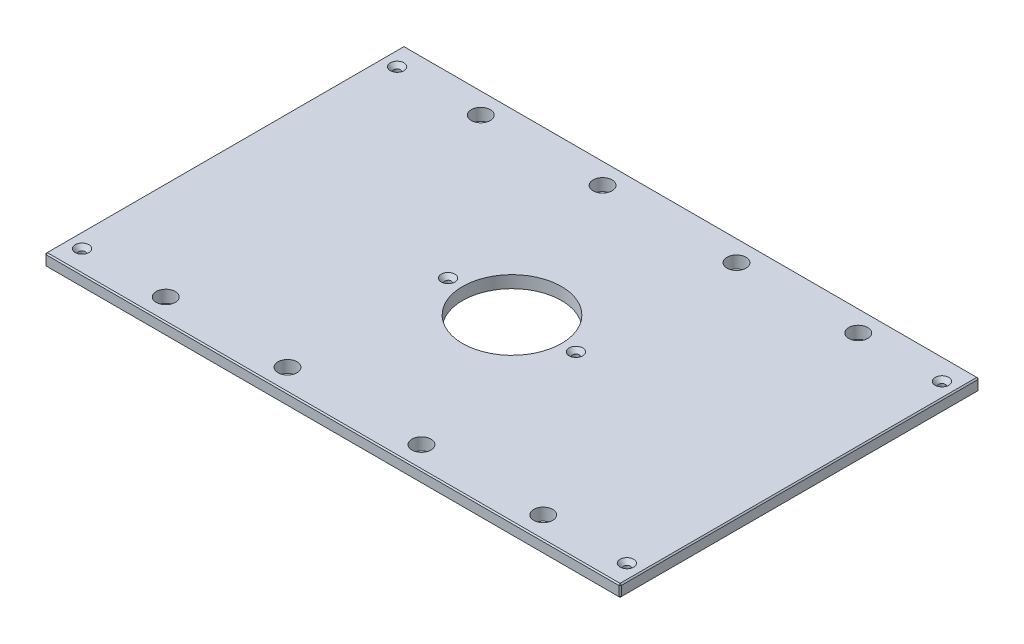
ISO-10303-21;
HEADER;
FILE_DESCRIPTION(('STEP AP214'),'2;1');
FILE_NAME('part.step','',(''),(''),'','','');
FILE_SCHEMA(('AUTOMOTIVE_DESIGN { 1 0 10303 214 1 1 1 1 }'));
ENDSEC;
DATA;
#1=APPLICATION_CONTEXT('core data for automotive mechanical design processes');
#2=APPLICATION_PROTOCOL_DEFINITION('international standard','automotive_design',2000,#1);
#3=PRODUCT_CONTEXT('',#1,'mechanical');
#4=PRODUCT('Part','Part','',(#3));
#5=PRODUCT_RELATED_PRODUCT_CATEGORY('part','',(#4));
#6=PRODUCT_DEFINITION_FORMATION('','',#4);
#7=PRODUCT_DEFINITION_CONTEXT('part definition',#1,'design');
#8=PRODUCT_DEFINITION('design','',#6,#7);
#9=PRODUCT_DEFINITION_SHAPE('','',#8);
#10=(LENGTH_UNIT() NAMED_UNIT(*) SI_UNIT(.MILLI.,.METRE.));
#11=(NAMED_UNIT(*) PLANE_ANGLE_UNIT() SI_UNIT($,.RADIAN.));
#12=(NAMED_UNIT(*) SI_UNIT($,.STERADIAN.) SOLID_ANGLE_UNIT());
#13=UNCERTAINTY_MEASURE_WITH_UNIT(LENGTH_MEASURE(1.E-05),#10,'distance_accuracy_value','');
#14=(GEOMETRIC_REPRESENTATION_CONTEXT(3) GLOBAL_UNCERTAINTY_ASSIGNED_CONTEXT((#13)) GLOBAL_UNIT_ASSIGNED_CONTEXT((#10,
#11,#12)) REPRESENTATION_CONTEXT('',''));
#15=CARTESIAN_POINT('',(0.,0.,0.));
#16=DIRECTION('',(0.,0.,1.));
#17=DIRECTION('',(1.,0.,0.));
#18=AXIS2_PLACEMENT_3D('',#15,#16,#17);
#19=CARTESIAN_POINT('',(-300.0375,12.7,-187.325));
#20=DIRECTION('',(1.,0.,0.));
#21=DIRECTION('',(0.,0.,-1.));
#22=AXIS2_PLACEMENT_3D('',#19,#20,#21);
#23=PLANE('',#22);
#24=DIRECTION('',(0.,0.,-1.));
#25=VECTOR('',#24,1.);
#26=CARTESIAN_POINT('',(-300.0375,11.43,-187.325));
#27=LINE('',#26,#25);
#28=CARTESIAN_POINT('',(-300.0375,11.43,186.055));
#29=VERTEX_POINT('',#28);
#30=CARTESIAN_POINT('',(-300.0375,11.43,-186.055));
#31=VERTEX_POINT('',#30);
#32=EDGE_CURVE('E134',#29,#31,#27,.T.);
#33=ORIENTED_EDGE('',*,*,#32,.T.);
#34=DIRECTION('',(0.,-1.,0.));
#35=VECTOR('',#34,1.);
#36=CARTESIAN_POINT('',(-300.0375,12.7,-186.055));
#37=LINE('',#36,#35);
#38=CARTESIAN_POINT('',(-300.0375,1.26999999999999,-186.055));
#39=VERTEX_POINT('',#38);
#40=EDGE_CURVE('E130',#31,#39,#37,.T.);
#41=ORIENTED_EDGE('',*,*,#40,.T.);
#42=DIRECTION('',(0.,0.,1.));
#43=VECTOR('',#42,1.);
#44=CARTESIAN_POINT('',(-300.0375,1.26999999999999,-187.325));
#45=LINE('',#44,#43);
#46=CARTESIAN_POINT('',(-300.0375,1.26999999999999,186.055));
#47=VERTEX_POINT('',#46);
#48=EDGE_CURVE('E125',#39,#47,#45,.T.);
#49=ORIENTED_EDGE('',*,*,#48,.T.);
#50=DIRECTION('',(0.,1.,0.));
#51=VECTOR('',#50,1.);
#52=CARTESIAN_POINT('',(-300.0375,12.7,186.055));
#53=LINE('',#52,#51);
#54=EDGE_CURVE('E127',#47,#29,#53,.T.);
#55=ORIENTED_EDGE('',*,*,#54,.T.);
#56=EDGE_LOOP('',(#33,#41,#49,#55));
#57=FACE_BOUND('',#56,.T.);
#58=ADVANCED_FACE('F34',(#57),#23,.F.);
#59=CARTESIAN_POINT('',(-300.0375,12.7,187.325));
#60=DIRECTION('',(0.,0.,-1.));
#61=DIRECTION('',(-1.,0.,0.));
#62=AXIS2_PLACEMENT_3D('',#59,#60,#61);
#63=PLANE('',#62);
#64=DIRECTION('',(1.,0.,0.));
#65=VECTOR('',#64,1.);
#66=CARTESIAN_POINT('',(-300.0375,1.26999999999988,187.325));
#67=LINE('',#66,#65);
#68=CARTESIAN_POINT('',(-298.7675,1.26999999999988,187.325));
#69=VERTEX_POINT('',#68);
#70=CARTESIAN_POINT('',(298.7675,1.26999999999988,187.325));
#71=VERTEX_POINT('',#70);
#72=EDGE_CURVE('E57',#69,#71,#67,.T.);
#73=ORIENTED_EDGE('',*,*,#72,.T.);
#74=DIRECTION('',(0.,1.,0.));
#75=VECTOR('',#74,1.);
#76=CARTESIAN_POINT('',(298.7675,12.7,187.325));
#77=LINE('',#76,#75);
#78=CARTESIAN_POINT('',(298.7675,11.4300000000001,187.325));
#79=VERTEX_POINT('',#78);
#80=EDGE_CURVE('E11',#71,#79,#77,.T.);
#81=ORIENTED_EDGE('',*,*,#80,.T.);
#82=DIRECTION('',(-1.,0.,0.));
#83=VECTOR('',#82,1.);
#84=CARTESIAN_POINT('',(-300.0375,11.4300000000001,187.325));
#85=LINE('',#84,#83);
#86=CARTESIAN_POINT('',(-298.7675,11.4300000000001,187.325));
#87=VERTEX_POINT('',#86);
#88=EDGE_CURVE('E43',#79,#87,#85,.T.);
#89=ORIENTED_EDGE('',*,*,#88,.T.);
#90=DIRECTION('',(0.,-1.,0.));
#91=VECTOR('',#90,1.);
#92=CARTESIAN_POINT('',(-298.7675,12.7,187.325));
#93=LINE('',#92,#91);
#94=EDGE_CURVE('E302',#87,#69,#93,.T.);
#95=ORIENTED_EDGE('',*,*,#94,.T.);
#96=EDGE_LOOP('',(#73,#81,#89,#95));
#97=FACE_BOUND('',#96,.T.);
#98=ADVANCED_FACE('F371',(#97),#63,.F.);
#99=CARTESIAN_POINT('',(300.0375,12.7,-187.325));
#100=DIRECTION('',(-1.,0.,0.));
#101=DIRECTION('',(0.,0.,1.));
#102=AXIS2_PLACEMENT_3D('',#99,#100,#101);
#103=PLANE('',#102);
#104=DIRECTION('',(0.,0.,-1.));
#105=VECTOR('',#104,1.);
#106=CARTESIAN_POINT('',(300.0375,1.26999999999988,-187.325));
#107=LINE('',#106,#105);
#108=CARTESIAN_POINT('',(300.0375,1.26999999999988,186.055));
#109=VERTEX_POINT('',#108);
#110=CARTESIAN_POINT('',(300.0375,1.26999999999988,-186.055));
#111=VERTEX_POINT('',#110);
#112=EDGE_CURVE('E297',#109,#111,#107,.T.);
#113=ORIENTED_EDGE('',*,*,#112,.T.);
#114=DIRECTION('',(0.,1.,0.));
#115=VECTOR('',#114,1.);
#116=CARTESIAN_POINT('',(300.0375,12.7,-186.055));
#117=LINE('',#116,#115);
#118=CARTESIAN_POINT('',(300.0375,11.43,-186.055));
#119=VERTEX_POINT('',#118);
#120=EDGE_CURVE('E299',#111,#119,#117,.T.);
#121=ORIENTED_EDGE('',*,*,#120,.T.);
#122=DIRECTION('',(0.,0.,1.));
#123=VECTOR('',#122,1.);
#124=CARTESIAN_POINT('',(300.0375,11.43,187.325));
#125=LINE('',#124,#123);
#126=CARTESIAN_POINT('',(300.0375,11.43,186.055));
#127=VERTEX_POINT('',#126);
#128=EDGE_CURVE('E295',#119,#127,#125,.T.);
#129=ORIENTED_EDGE('',*,*,#128,.T.);
#130=DIRECTION('',(0.,-1.,0.));
#131=VECTOR('',#130,1.);
#132=CARTESIAN_POINT('',(300.0375,12.7,186.055));
#133=LINE('',#132,#131);
#134=EDGE_CURVE('E293',#127,#109,#133,.T.);
#135=ORIENTED_EDGE('',*,*,#134,.T.);
#136=EDGE_LOOP('',(#113,#121,#129,#135));
#137=FACE_BOUND('',#136,.T.);
#138=ADVANCED_FACE('F358',(#137),#103,.F.);
#139=CARTESIAN_POINT('',(-300.0375,12.7,-187.325));
#140=DIRECTION('',(0.,0.,1.));
#141=DIRECTION('',(1.,0.,0.));
#142=AXIS2_PLACEMENT_3D('',#139,#140,#141);
#143=PLANE('',#142);
#144=DIRECTION('',(-1.,0.,0.));
#145=VECTOR('',#144,1.);
#146=CARTESIAN_POINT('',(-300.0375,1.26999999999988,-187.325));
#147=LINE('',#146,#145);
#148=CARTESIAN_POINT('',(298.7675,1.26999999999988,-187.325));
#149=VERTEX_POINT('',#148);
#150=CARTESIAN_POINT('',(-298.7675,1.26999999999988,-187.325));
#151=VERTEX_POINT('',#150);
#152=EDGE_CURVE('E269',#149,#151,#147,.T.);
#153=ORIENTED_EDGE('',*,*,#152,.T.);
#154=DIRECTION('',(0.,1.,0.));
#155=VECTOR('',#154,1.);
#156=CARTESIAN_POINT('',(-298.7675,12.7,-187.325));
#157=LINE('',#156,#155);
#158=CARTESIAN_POINT('',(-298.7675,11.43,-187.325));
#159=VERTEX_POINT('',#158);
#160=EDGE_CURVE('E273',#151,#159,#157,.T.);
#161=ORIENTED_EDGE('',*,*,#160,.T.);
#162=DIRECTION('',(1.,0.,0.));
#163=VECTOR('',#162,1.);
#164=CARTESIAN_POINT('',(300.0375,11.43,-187.325));
#165=LINE('',#164,#163);
#166=CARTESIAN_POINT('',(298.7675,11.43,-187.325));
#167=VERTEX_POINT('',#166);
#168=EDGE_CURVE('E271',#159,#167,#165,.T.);
#169=ORIENTED_EDGE('',*,*,#168,.T.);
#170=DIRECTION('',(0.,-1.,0.));
#171=VECTOR('',#170,1.);
#172=CARTESIAN_POINT('',(298.7675,12.7,-187.325));
#173=LINE('',#172,#171);
#174=EDGE_CURVE('E267',#167,#149,#173,.T.);
#175=ORIENTED_EDGE('',*,*,#174,.T.);
#176=EDGE_LOOP('',(#153,#161,#169,#175));
#177=FACE_BOUND('',#176,.T.);
#178=ADVANCED_FACE('F332',(#177),#143,.F.);
#179=CARTESIAN_POINT('',(0.,12.7,0.));
#180=DIRECTION('',(0.,1.,0.));
#181=DIRECTION('',(0.,0.,1.));
#182=AXIS2_PLACEMENT_3D('',#179,#180,#181);
#183=PLANE('',#182);
#184=CARTESIAN_POINT('',(284.1625,12.7,-164.30498));
#185=DIRECTION('',(0.,1.,0.));
#186=DIRECTION('',(0.,0.,1.));
#187=AXIS2_PLACEMENT_3D('',#184,#185,#186);
#188=CIRCLE('',#187,7.13740000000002);
#189=CARTESIAN_POINT('',(284.1625,12.7,-157.16758));
#190=VERTEX_POINT('',#189);
#191=EDGE_CURVE('E815',#190,#190,#188,.T.);
#192=ORIENTED_EDGE('',*,*,#191,.F.);
#193=EDGE_LOOP('',(#192));
#194=FACE_BOUND('',#193,.T.);
#195=CARTESIAN_POINT('',(284.1625,12.7,164.30498));
#196=DIRECTION('',(0.,1.,0.));
#197=DIRECTION('',(0.,0.,1.));
#198=AXIS2_PLACEMENT_3D('',#195,#196,#197);
#199=CIRCLE('',#198,7.13740000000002);
#200=CARTESIAN_POINT('',(284.1625,12.7,171.44238));
#201=VERTEX_POINT('',#200);
#202=EDGE_CURVE('E819',#201,#201,#199,.T.);
#203=ORIENTED_EDGE('',*,*,#202,.F.);
#204=EDGE_LOOP('',(#203));
#205=FACE_BOUND('',#204,.T.);
#206=CARTESIAN_POINT('',(-284.1625,12.7,164.30498));
#207=DIRECTION('',(0.,1.,0.));
#208=DIRECTION('',(0.,0.,1.));
#209=AXIS2_PLACEMENT_3D('',#206,#207,#208);
#210=CIRCLE('',#209,7.13740000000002);
#211=CARTESIAN_POINT('',(-284.1625,12.7,171.44238));
#212=VERTEX_POINT('',#211);
#213=EDGE_CURVE('E823',#212,#212,#210,.T.);
#214=ORIENTED_EDGE('',*,*,#213,.F.);
#215=EDGE_LOOP('',(#214));
#216=FACE_BOUND('',#215,.T.);
#217=CARTESIAN_POINT('',(-66.675,12.7,0.));
#218=DIRECTION('',(0.,1.,0.));
#219=DIRECTION('',(0.,0.,1.));
#220=AXIS2_PLACEMENT_3D('',#217,#218,#219);
#221=CIRCLE('',#220,7.1374);
#222=CARTESIAN_POINT('',(-66.675,12.7,7.1374));
#223=VERTEX_POINT('',#222);
#224=EDGE_CURVE('E827',#223,#223,#221,.T.);
#225=ORIENTED_EDGE('',*,*,#224,.F.);
#226=EDGE_LOOP('',(#225));
#227=FACE_BOUND('',#226,.T.);
#228=CARTESIAN_POINT('',(66.675,12.7,0.));
#229=DIRECTION('',(0.,1.,0.));
#230=DIRECTION('',(0.,0.,1.));
#231=AXIS2_PLACEMENT_3D('',#228,#229,#230);
#232=CIRCLE('',#231,7.1374);
#233=CARTESIAN_POINT('',(66.675,12.7,7.1374));
#234=VERTEX_POINT('',#233);
#235=EDGE_CURVE('E831',#234,#234,#232,.T.);
#236=ORIENTED_EDGE('',*,*,#235,.F.);
#237=EDGE_LOOP('',(#236));
#238=FACE_BOUND('',#237,.T.);
#239=CARTESIAN_POINT('',(-284.1625,12.7,-164.30498));
#240=DIRECTION('',(0.,1.,0.));
#241=DIRECTION('',(0.,0.,1.));
#242=AXIS2_PLACEMENT_3D('',#239,#240,#241);
#243=CIRCLE('',#242,7.13740000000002);
#244=CARTESIAN_POINT('',(-284.1625,12.7,-157.16758));
#245=VERTEX_POINT('',#244);
#246=EDGE_CURVE('E834',#245,#245,#243,.T.);
#247=ORIENTED_EDGE('',*,*,#246,.F.);
#248=EDGE_LOOP('',(#247));
#249=FACE_BOUND('',#248,.T.);
#250=DIRECTION('',(0.,0.,-1.));
#251=VECTOR('',#250,1.);
#252=CARTESIAN_POINT('',(298.7675,12.7,-187.325));
#253=LINE('',#252,#251);
#254=CARTESIAN_POINT('',(298.7675,12.7,186.055));
#255=VERTEX_POINT('',#254);
#256=CARTESIAN_POINT('',(298.7675,12.7,-186.055));
#257=VERTEX_POINT('',#256);
#258=EDGE_CURVE('E280',#255,#257,#253,.T.);
#259=ORIENTED_EDGE('',*,*,#258,.T.);
#260=DIRECTION('',(-1.,0.,0.));
#261=VECTOR('',#260,1.);
#262=CARTESIAN_POINT('',(-300.0375,12.7,-186.055));
#263=LINE('',#262,#261);
#264=CARTESIAN_POINT('',(-298.7675,12.7,-186.055));
#265=VERTEX_POINT('',#264);
#266=EDGE_CURVE('E282',#257,#265,#263,.T.);
#267=ORIENTED_EDGE('',*,*,#266,.T.);
#268=DIRECTION('',(0.,0.,1.));
#269=VECTOR('',#268,1.);
#270=CARTESIAN_POINT('',(-298.7675,12.7,187.325));
#271=LINE('',#270,#269);
#272=CARTESIAN_POINT('',(-298.7675,12.7,186.055));
#273=VERTEX_POINT('',#272);
#274=EDGE_CURVE('E278',#265,#273,#271,.T.);
#275=ORIENTED_EDGE('',*,*,#274,.T.);
#276=DIRECTION('',(1.,0.,0.));
#277=VECTOR('',#276,1.);
#278=CARTESIAN_POINT('',(300.0375,12.7,186.055));
#279=LINE('',#278,#277);
#280=EDGE_CURVE('E276',#273,#255,#279,.T.);
#281=ORIENTED_EDGE('',*,*,#280,.T.);
#282=EDGE_LOOP('',(#259,#267,#275,#281));
#283=FACE_BOUND('',#282,.T.);
#284=CARTESIAN_POINT('',(196.85,12.7,-164.30498));
#285=DIRECTION('',(0.,1.,0.));
#286=DIRECTION('',(0.,0.,1.));
#287=AXIS2_PLACEMENT_3D('',#284,#285,#286);
#288=CIRCLE('',#287,9.921875);
#289=CARTESIAN_POINT('',(196.85,12.7,-154.383105));
#290=VERTEX_POINT('',#289);
#291=EDGE_CURVE('E203',#290,#290,#288,.T.);
#292=ORIENTED_EDGE('',*,*,#291,.F.);
#293=EDGE_LOOP('',(#292));
#294=FACE_BOUND('',#293,.T.);
#295=CARTESIAN_POINT('',(-196.85,12.7,-164.30498));
#296=DIRECTION('',(0.,1.,0.));
#297=DIRECTION('',(0.,0.,1.));
#298=AXIS2_PLACEMENT_3D('',#295,#296,#297);
#299=CIRCLE('',#298,9.921875);
#300=CARTESIAN_POINT('',(-196.85,12.7,-154.383105));
#301=VERTEX_POINT('',#300);
#302=EDGE_CURVE('E213',#301,#301,#299,.T.);
#303=ORIENTED_EDGE('',*,*,#302,.F.);
#304=EDGE_LOOP('',(#303));
#305=FACE_BOUND('',#304,.T.);
#306=CARTESIAN_POINT('',(196.85,12.7,164.30498));
#307=DIRECTION('',(0.,1.,0.));
#308=DIRECTION('',(0.,0.,1.));
#309=AXIS2_PLACEMENT_3D('',#306,#307,#308);
#310=CIRCLE('',#309,9.921875);
#311=CARTESIAN_POINT('',(196.85,12.7,174.226855));
#312=VERTEX_POINT('',#311);
#313=EDGE_CURVE('E224',#312,#312,#310,.T.);
#314=ORIENTED_EDGE('',*,*,#313,.F.);
#315=EDGE_LOOP('',(#314));
#316=FACE_BOUND('',#315,.T.);
#317=CARTESIAN_POINT('',(-196.85,12.7,164.30498));
#318=DIRECTION('',(0.,1.,0.));
#319=DIRECTION('',(0.,0.,1.));
#320=AXIS2_PLACEMENT_3D('',#317,#318,#319);
#321=CIRCLE('',#320,9.921875);
#322=CARTESIAN_POINT('',(-196.85,12.7,174.226855));
#323=VERTEX_POINT('',#322);
#324=EDGE_CURVE('E230',#323,#323,#321,.T.);
#325=ORIENTED_EDGE('',*,*,#324,.F.);
#326=EDGE_LOOP('',(#325));
#327=FACE_BOUND('',#326,.T.);
#328=CARTESIAN_POINT('',(-69.85,12.7,-164.30498));
#329=DIRECTION('',(0.,1.,0.));
#330=DIRECTION('',(0.,0.,1.));
#331=AXIS2_PLACEMENT_3D('',#328,#329,#330);
#332=CIRCLE('',#331,9.921875);
#333=CARTESIAN_POINT('',(-69.85,12.7,-154.383105));
#334=VERTEX_POINT('',#333);
#335=EDGE_CURVE('E236',#334,#334,#332,.T.);
#336=ORIENTED_EDGE('',*,*,#335,.F.);
#337=EDGE_LOOP('',(#336));
#338=FACE_BOUND('',#337,.T.);
#339=CARTESIAN_POINT('',(69.85,12.7,-164.30498));
#340=DIRECTION('',(0.,1.,0.));
#341=DIRECTION('',(0.,0.,1.));
#342=AXIS2_PLACEMENT_3D('',#339,#340,#341);
#343=CIRCLE('',#342,9.921875);
#344=CARTESIAN_POINT('',(69.85,12.7,-154.383105));
#345=VERTEX_POINT('',#344);
#346=EDGE_CURVE('E242',#345,#345,#343,.T.);
#347=ORIENTED_EDGE('',*,*,#346,.F.);
#348=EDGE_LOOP('',(#347));
#349=FACE_BOUND('',#348,.T.);
#350=CARTESIAN_POINT('',(69.85,12.7,164.30498));
#351=DIRECTION('',(0.,1.,0.));
#352=DIRECTION('',(0.,0.,1.));
#353=AXIS2_PLACEMENT_3D('',#350,#351,#352);
#354=CIRCLE('',#353,9.921875);
#355=CARTESIAN_POINT('',(69.85,12.7,174.226855));
#356=VERTEX_POINT('',#355);
#357=EDGE_CURVE('E248',#356,#356,#354,.T.);
#358=ORIENTED_EDGE('',*,*,#357,.F.);
#359=EDGE_LOOP('',(#358));
#360=FACE_BOUND('',#359,.T.);
#361=CARTESIAN_POINT('',(-69.85,12.7,164.30498));
#362=DIRECTION('',(0.,1.,0.));
#363=DIRECTION('',(0.,0.,1.));
#364=AXIS2_PLACEMENT_3D('',#361,#362,#363);
#365=CIRCLE('',#364,9.921875);
#366=CARTESIAN_POINT('',(-69.85,12.7,174.226855));
#367=VERTEX_POINT('',#366);
#368=EDGE_CURVE('E254',#367,#367,#365,.T.);
#369=ORIENTED_EDGE('',*,*,#368,.F.);
#370=EDGE_LOOP('',(#369));
#371=FACE_BOUND('',#370,.T.);
#372=CARTESIAN_POINT('',(0.,12.7,0.));
#373=DIRECTION('',(0.,1.,0.));
#374=DIRECTION('',(0.,0.,1.));
#375=AXIS2_PLACEMENT_3D('',#372,#373,#374);
#376=CIRCLE('',#375,51.562);
#377=CARTESIAN_POINT('',(0.,12.7,51.562));
#378=VERTEX_POINT('',#377);
#379=EDGE_CURVE('E260',#378,#378,#376,.T.);
#380=ORIENTED_EDGE('',*,*,#379,.F.);
#381=EDGE_LOOP('',(#380));
#382=FACE_BOUND('',#381,.T.);
#383=ADVANCED_FACE('F380',(#194,#205,#216,#227,#238,#249,#283,#294,#305,#316,#327,#338,#349,
#360,#371,#382),#183,.T.);
#384=CARTESIAN_POINT('',(0.,0.,0.));
#385=DIRECTION('',(0.,1.,0.));
#386=DIRECTION('',(0.,0.,1.));
#387=AXIS2_PLACEMENT_3D('',#384,#385,#386);
#388=PLANE('',#387);
#389=CARTESIAN_POINT('',(284.1625,0.,-164.30498));
#390=DIRECTION('',(0.,1.,0.));
#391=DIRECTION('',(0.,0.,1.));
#392=AXIS2_PLACEMENT_3D('',#389,#390,#391);
#393=CIRCLE('',#392,3.3782);
#394=CARTESIAN_POINT('',(284.1625,0.,-160.92678));
#395=VERTEX_POINT('',#394);
#396=EDGE_CURVE('E868',#395,#395,#393,.T.);
#397=ORIENTED_EDGE('',*,*,#396,.T.);
#398=EDGE_LOOP('',(#397));
#399=FACE_BOUND('',#398,.T.);
#400=CARTESIAN_POINT('',(284.1625,0.,164.30498));
#401=DIRECTION('',(0.,1.,0.));
#402=DIRECTION('',(0.,0.,1.));
#403=AXIS2_PLACEMENT_3D('',#400,#401,#402);
#404=CIRCLE('',#403,3.3782);
#405=CARTESIAN_POINT('',(284.1625,0.,167.68318));
#406=VERTEX_POINT('',#405);
#407=EDGE_CURVE('E861',#406,#406,#404,.T.);
#408=ORIENTED_EDGE('',*,*,#407,.T.);
#409=EDGE_LOOP('',(#408));
#410=FACE_BOUND('',#409,.T.);
#411=CARTESIAN_POINT('',(-284.1625,0.,164.30498));
#412=DIRECTION('',(0.,1.,0.));
#413=DIRECTION('',(0.,0.,1.));
#414=AXIS2_PLACEMENT_3D('',#411,#412,#413);
#415=CIRCLE('',#414,3.3782);
#416=CARTESIAN_POINT('',(-284.1625,0.,167.68318));
#417=VERTEX_POINT('',#416);
#418=EDGE_CURVE('E854',#417,#417,#415,.T.);
#419=ORIENTED_EDGE('',*,*,#418,.T.);
#420=EDGE_LOOP('',(#419));
#421=FACE_BOUND('',#420,.T.);
#422=CARTESIAN_POINT('',(-66.675,0.,0.));
#423=DIRECTION('',(0.,1.,0.));
#424=DIRECTION('',(0.,0.,1.));
#425=AXIS2_PLACEMENT_3D('',#422,#423,#424);
#426=CIRCLE('',#425,3.3782);
#427=CARTESIAN_POINT('',(-66.675,0.,3.3782));
#428=VERTEX_POINT('',#427);
#429=EDGE_CURVE('E847',#428,#428,#426,.T.);
#430=ORIENTED_EDGE('',*,*,#429,.T.);
#431=EDGE_LOOP('',(#430));
#432=FACE_BOUND('',#431,.T.);
#433=CARTESIAN_POINT('',(66.675,0.,0.));
#434=DIRECTION('',(0.,1.,0.));
#435=DIRECTION('',(0.,0.,1.));
#436=AXIS2_PLACEMENT_3D('',#433,#434,#435);
#437=CIRCLE('',#436,3.3782);
#438=CARTESIAN_POINT('',(66.675,0.,3.3782));
#439=VERTEX_POINT('',#438);
#440=EDGE_CURVE('E837',#439,#439,#437,.T.);
#441=ORIENTED_EDGE('',*,*,#440,.T.);
#442=EDGE_LOOP('',(#441));
#443=FACE_BOUND('',#442,.T.);
#444=CARTESIAN_POINT('',(-284.1625,0.,-164.30498));
#445=DIRECTION('',(0.,1.,0.));
#446=DIRECTION('',(0.,0.,1.));
#447=AXIS2_PLACEMENT_3D('',#444,#445,#446);
#448=CIRCLE('',#447,3.3782);
#449=CARTESIAN_POINT('',(-284.1625,0.,-160.92678));
#450=VERTEX_POINT('',#449);
#451=EDGE_CURVE('E216',#450,#450,#448,.T.);
#452=ORIENTED_EDGE('',*,*,#451,.T.);
#453=EDGE_LOOP('',(#452));
#454=FACE_BOUND('',#453,.T.);
#455=DIRECTION('',(0.,0.,-1.));
#456=VECTOR('',#455,1.);
#457=CARTESIAN_POINT('',(-298.7675,0.,0.));
#458=LINE('',#457,#456);
#459=CARTESIAN_POINT('',(-298.7675,0.,186.055));
#460=VERTEX_POINT('',#459);
#461=CARTESIAN_POINT('',(-298.7675,0.,-186.055));
#462=VERTEX_POINT('',#461);
#463=EDGE_CURVE('E157',#460,#462,#458,.T.);
#464=ORIENTED_EDGE('',*,*,#463,.T.);
#465=DIRECTION('',(1.,0.,0.));
#466=VECTOR('',#465,1.);
#467=CARTESIAN_POINT('',(0.,0.,-186.055));
#468=LINE('',#467,#466);
#469=CARTESIAN_POINT('',(298.7675,0.,-186.055));
#470=VERTEX_POINT('',#469);
#471=EDGE_CURVE('E290',#462,#470,#468,.T.);
#472=ORIENTED_EDGE('',*,*,#471,.T.);
#473=DIRECTION('',(0.,0.,1.));
#474=VECTOR('',#473,1.);
#475=CARTESIAN_POINT('',(298.7675,0.,0.));
#476=LINE('',#475,#474);
#477=CARTESIAN_POINT('',(298.7675,0.,186.055));
#478=VERTEX_POINT('',#477);
#479=EDGE_CURVE('E288',#470,#478,#476,.T.);
#480=ORIENTED_EDGE('',*,*,#479,.T.);
#481=DIRECTION('',(-1.,0.,0.));
#482=VECTOR('',#481,1.);
#483=CARTESIAN_POINT('',(0.,0.,186.055));
#484=LINE('',#483,#482);
#485=EDGE_CURVE('E285',#478,#460,#484,.T.);
#486=ORIENTED_EDGE('',*,*,#485,.T.);
#487=EDGE_LOOP('',(#464,#472,#480,#486));
#488=FACE_BOUND('',#487,.T.);
#489=CARTESIAN_POINT('',(196.85,0.,-164.30498));
#490=DIRECTION('',(0.,1.,0.));
#491=DIRECTION('',(0.,0.,1.));
#492=AXIS2_PLACEMENT_3D('',#489,#490,#491);
#493=CIRCLE('',#492,9.921875);
#494=CARTESIAN_POINT('',(196.85,0.,-154.383105));
#495=VERTEX_POINT('',#494);
#496=EDGE_CURVE('E208',#495,#495,#493,.T.);
#497=ORIENTED_EDGE('',*,*,#496,.T.);
#498=EDGE_LOOP('',(#497));
#499=FACE_BOUND('',#498,.T.);
#500=CARTESIAN_POINT('',(-196.85,0.,-164.30498));
#501=DIRECTION('',(0.,1.,0.));
#502=DIRECTION('',(0.,0.,1.));
#503=AXIS2_PLACEMENT_3D('',#500,#501,#502);
#504=CIRCLE('',#503,9.921875);
#505=CARTESIAN_POINT('',(-196.85,0.,-154.383105));
#506=VERTEX_POINT('',#505);
#507=EDGE_CURVE('E221',#506,#506,#504,.T.);
#508=ORIENTED_EDGE('',*,*,#507,.T.);
#509=EDGE_LOOP('',(#508));
#510=FACE_BOUND('',#509,.T.);
#511=CARTESIAN_POINT('',(196.85,0.,164.30498));
#512=DIRECTION('',(0.,1.,0.));
#513=DIRECTION('',(0.,0.,1.));
#514=AXIS2_PLACEMENT_3D('',#511,#512,#513);
#515=CIRCLE('',#514,9.921875);
#516=CARTESIAN_POINT('',(196.85,0.,174.226855));
#517=VERTEX_POINT('',#516);
#518=EDGE_CURVE('E227',#517,#517,#515,.T.);
#519=ORIENTED_EDGE('',*,*,#518,.T.);
#520=EDGE_LOOP('',(#519));
#521=FACE_BOUND('',#520,.T.);
#522=CARTESIAN_POINT('',(-196.85,0.,164.30498));
#523=DIRECTION('',(0.,1.,0.));
#524=DIRECTION('',(0.,0.,1.));
#525=AXIS2_PLACEMENT_3D('',#522,#523,#524);
#526=CIRCLE('',#525,9.921875);
#527=CARTESIAN_POINT('',(-196.85,0.,174.226855));
#528=VERTEX_POINT('',#527);
#529=EDGE_CURVE('E233',#528,#528,#526,.T.);
#530=ORIENTED_EDGE('',*,*,#529,.T.);
#531=EDGE_LOOP('',(#530));
#532=FACE_BOUND('',#531,.T.);
#533=CARTESIAN_POINT('',(-69.85,0.,-164.30498));
#534=DIRECTION('',(0.,1.,0.));
#535=DIRECTION('',(0.,0.,1.));
#536=AXIS2_PLACEMENT_3D('',#533,#534,#535);
#537=CIRCLE('',#536,9.921875);
#538=CARTESIAN_POINT('',(-69.85,0.,-154.383105));
#539=VERTEX_POINT('',#538);
#540=EDGE_CURVE('E239',#539,#539,#537,.T.);
#541=ORIENTED_EDGE('',*,*,#540,.T.);
#542=EDGE_LOOP('',(#541));
#543=FACE_BOUND('',#542,.T.);
#544=CARTESIAN_POINT('',(69.85,0.,-164.30498));
#545=DIRECTION('',(0.,1.,0.));
#546=DIRECTION('',(0.,0.,1.));
#547=AXIS2_PLACEMENT_3D('',#544,#545,#546);
#548=CIRCLE('',#547,9.921875);
#549=CARTESIAN_POINT('',(69.85,0.,-154.383105));
#550=VERTEX_POINT('',#549);
#551=EDGE_CURVE('E245',#550,#550,#548,.T.);
#552=ORIENTED_EDGE('',*,*,#551,.T.);
#553=EDGE_LOOP('',(#552));
#554=FACE_BOUND('',#553,.T.);
#555=CARTESIAN_POINT('',(69.85,0.,164.30498));
#556=DIRECTION('',(0.,1.,0.));
#557=DIRECTION('',(0.,0.,1.));
#558=AXIS2_PLACEMENT_3D('',#555,#556,#557);
#559=CIRCLE('',#558,9.921875);
#560=CARTESIAN_POINT('',(69.85,0.,174.226855));
#561=VERTEX_POINT('',#560);
#562=EDGE_CURVE('E251',#561,#561,#559,.T.);
#563=ORIENTED_EDGE('',*,*,#562,.T.);
#564=EDGE_LOOP('',(#563));
#565=FACE_BOUND('',#564,.T.);
#566=CARTESIAN_POINT('',(-69.85,0.,164.30498));
#567=DIRECTION('',(0.,1.,0.));
#568=DIRECTION('',(0.,0.,1.));
#569=AXIS2_PLACEMENT_3D('',#566,#567,#568);
#570=CIRCLE('',#569,9.921875);
#571=CARTESIAN_POINT('',(-69.85,0.,174.226855));
#572=VERTEX_POINT('',#571);
#573=EDGE_CURVE('E257',#572,#572,#570,.T.);
#574=ORIENTED_EDGE('',*,*,#573,.T.);
#575=EDGE_LOOP('',(#574));
#576=FACE_BOUND('',#575,.T.);
#577=CARTESIAN_POINT('',(0.,0.,0.));
#578=DIRECTION('',(0.,1.,0.));
#579=DIRECTION('',(0.,0.,1.));
#580=AXIS2_PLACEMENT_3D('',#577,#578,#579);
#581=CIRCLE('',#580,51.562);
#582=CARTESIAN_POINT('',(0.,0.,51.562));
#583=VERTEX_POINT('',#582);
#584=EDGE_CURVE('E146',#583,#583,#581,.T.);
#585=ORIENTED_EDGE('',*,*,#584,.T.);
#586=EDGE_LOOP('',(#585));
#587=FACE_BOUND('',#586,.T.);
#588=ADVANCED_FACE('F345',(#399,#410,#421,#432,#443,#454,#488,#499,#510,#521,#532,#543,#554,
#565,#576,#587),#388,.F.);
#589=CARTESIAN_POINT('',(0.,0.,0.));
#590=DIRECTION('',(0.,1.,0.));
#591=DIRECTION('',(0.,0.,1.));
#592=AXIS2_PLACEMENT_3D('',#589,#590,#591);
#593=CYLINDRICAL_SURFACE('',#592,51.562);
#594=ORIENTED_EDGE('',*,*,#584,.F.);
#595=EDGE_LOOP('',(#594));
#596=FACE_BOUND('',#595,.T.);
#597=ORIENTED_EDGE('',*,*,#379,.T.);
#598=EDGE_LOOP('',(#597));
#599=FACE_BOUND('',#598,.T.);
#600=ADVANCED_FACE('F750',(#596,#599),#593,.F.);
#601=CARTESIAN_POINT('',(-69.85,12.7,164.30498));
#602=DIRECTION('',(0.,1.,0.));
#603=DIRECTION('',(0.,0.,1.));
#604=AXIS2_PLACEMENT_3D('',#601,#602,#603);
#605=CYLINDRICAL_SURFACE('',#604,9.921875);
#606=ORIENTED_EDGE('',*,*,#573,.F.);
#607=EDGE_LOOP('',(#606));
#608=FACE_BOUND('',#607,.T.);
#609=ORIENTED_EDGE('',*,*,#368,.T.);
#610=EDGE_LOOP('',(#609));
#611=FACE_BOUND('',#610,.T.);
#612=ADVANCED_FACE('F741',(#608,#611),#605,.F.);
#613=CARTESIAN_POINT('',(69.85,12.7,164.30498));
#614=DIRECTION('',(0.,1.,0.));
#615=DIRECTION('',(0.,0.,1.));
#616=AXIS2_PLACEMENT_3D('',#613,#614,#615);
#617=CYLINDRICAL_SURFACE('',#616,9.921875);
#618=ORIENTED_EDGE('',*,*,#562,.F.);
#619=EDGE_LOOP('',(#618));
#620=FACE_BOUND('',#619,.T.);
#621=ORIENTED_EDGE('',*,*,#357,.T.);
#622=EDGE_LOOP('',(#621));
#623=FACE_BOUND('',#622,.T.);
#624=ADVANCED_FACE('F732',(#620,#623),#617,.F.);
#625=CARTESIAN_POINT('',(69.85,12.7,-164.30498));
#626=DIRECTION('',(0.,1.,0.));
#627=DIRECTION('',(0.,0.,1.));
#628=AXIS2_PLACEMENT_3D('',#625,#626,#627);
#629=CYLINDRICAL_SURFACE('',#628,9.921875);
#630=ORIENTED_EDGE('',*,*,#551,.F.);
#631=EDGE_LOOP('',(#630));
#632=FACE_BOUND('',#631,.T.);
#633=ORIENTED_EDGE('',*,*,#346,.T.);
#634=EDGE_LOOP('',(#633));
#635=FACE_BOUND('',#634,.T.);
#636=ADVANCED_FACE('F723',(#632,#635),#629,.F.);
#637=CARTESIAN_POINT('',(-69.85,12.7,-164.30498));
#638=DIRECTION('',(0.,1.,0.));
#639=DIRECTION('',(0.,0.,1.));
#640=AXIS2_PLACEMENT_3D('',#637,#638,#639);
#641=CYLINDRICAL_SURFACE('',#640,9.921875);
#642=ORIENTED_EDGE('',*,*,#540,.F.);
#643=EDGE_LOOP('',(#642));
#644=FACE_BOUND('',#643,.T.);
#645=ORIENTED_EDGE('',*,*,#335,.T.);
#646=EDGE_LOOP('',(#645));
#647=FACE_BOUND('',#646,.T.);
#648=ADVANCED_FACE('F714',(#644,#647),#641,.F.);
#649=CARTESIAN_POINT('',(-196.85,12.7,164.30498));
#650=DIRECTION('',(0.,1.,0.));
#651=DIRECTION('',(0.,0.,1.));
#652=AXIS2_PLACEMENT_3D('',#649,#650,#651);
#653=CYLINDRICAL_SURFACE('',#652,9.921875);
#654=ORIENTED_EDGE('',*,*,#529,.F.);
#655=EDGE_LOOP('',(#654));
#656=FACE_BOUND('',#655,.T.);
#657=ORIENTED_EDGE('',*,*,#324,.T.);
#658=EDGE_LOOP('',(#657));
#659=FACE_BOUND('',#658,.T.);
#660=ADVANCED_FACE('F705',(#656,#659),#653,.F.);
#661=CARTESIAN_POINT('',(196.85,12.7,164.30498));
#662=DIRECTION('',(0.,1.,0.));
#663=DIRECTION('',(0.,0.,1.));
#664=AXIS2_PLACEMENT_3D('',#661,#662,#663);
#665=CYLINDRICAL_SURFACE('',#664,9.921875);
#666=ORIENTED_EDGE('',*,*,#518,.F.);
#667=EDGE_LOOP('',(#666));
#668=FACE_BOUND('',#667,.T.);
#669=ORIENTED_EDGE('',*,*,#313,.T.);
#670=EDGE_LOOP('',(#669));
#671=FACE_BOUND('',#670,.T.);
#672=ADVANCED_FACE('F696',(#668,#671),#665,.F.);
#673=CARTESIAN_POINT('',(-196.85,12.7,-164.30498));
#674=DIRECTION('',(0.,1.,0.));
#675=DIRECTION('',(0.,0.,1.));
#676=AXIS2_PLACEMENT_3D('',#673,#674,#675);
#677=CYLINDRICAL_SURFACE('',#676,9.921875);
#678=ORIENTED_EDGE('',*,*,#507,.F.);
#679=EDGE_LOOP('',(#678));
#680=FACE_BOUND('',#679,.T.);
#681=ORIENTED_EDGE('',*,*,#302,.T.);
#682=EDGE_LOOP('',(#681));
#683=FACE_BOUND('',#682,.T.);
#684=ADVANCED_FACE('F686',(#680,#683),#677,.F.);
#685=CARTESIAN_POINT('',(196.85,12.7,-164.30498));
#686=DIRECTION('',(0.,1.,0.));
#687=DIRECTION('',(0.,0.,1.));
#688=AXIS2_PLACEMENT_3D('',#685,#686,#687);
#689=CYLINDRICAL_SURFACE('',#688,9.921875);
#690=ORIENTED_EDGE('',*,*,#496,.F.);
#691=EDGE_LOOP('',(#690));
#692=FACE_BOUND('',#691,.T.);
#693=ORIENTED_EDGE('',*,*,#291,.T.);
#694=EDGE_LOOP('',(#693));
#695=FACE_BOUND('',#694,.T.);
#696=ADVANCED_FACE('F389',(#692,#695),#689,.F.);
#697=CARTESIAN_POINT('',(300.0375,12.7,186.055));
#698=DIRECTION('',(-0.707106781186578,0.,-0.707106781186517));
#699=DIRECTION('',(0.,-1.,0.));
#700=AXIS2_PLACEMENT_3D('',#697,#698,#699);
#701=PLANE('',#700);
#702=DIRECTION('',(-0.707106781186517,0.,0.707106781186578));
#703=VECTOR('',#702,1.);
#704=CARTESIAN_POINT('',(300.0375,11.43,186.055));
#705=LINE('',#704,#703);
#706=EDGE_CURVE('E38',#79,#127,#705,.F.);
#707=ORIENTED_EDGE('',*,*,#706,.F.);
#708=ORIENTED_EDGE('',*,*,#80,.F.);
#709=DIRECTION('',(0.707106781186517,0.,-0.707106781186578));
#710=VECTOR('',#709,1.);
#711=CARTESIAN_POINT('',(299.4025,1.26999999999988,186.69));
#712=LINE('',#711,#710);
#713=EDGE_CURVE('E196',#109,#71,#712,.F.);
#714=ORIENTED_EDGE('',*,*,#713,.F.);
#715=ORIENTED_EDGE('',*,*,#134,.F.);
#716=EDGE_LOOP('',(#707,#708,#714,#715));
#717=FACE_BOUND('',#716,.T.);
#718=ADVANCED_FACE('F36',(#717),#701,.F.);
#719=CARTESIAN_POINT('',(300.0375,11.43,186.055));
#720=DIRECTION('',(0.577350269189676,0.577350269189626,0.577350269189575));
#721=DIRECTION('',(-0.707106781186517,0.707106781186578,0.));
#722=AXIS2_PLACEMENT_3D('',#719,#720,#721);
#723=PLANE('',#722);
#724=DIRECTION('',(0.,-0.707106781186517,0.707106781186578));
#725=VECTOR('',#724,1.);
#726=CARTESIAN_POINT('',(298.7675,12.0650000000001,186.69));
#727=LINE('',#726,#725);
#728=EDGE_CURVE('E192',#79,#255,#727,.F.);
#729=ORIENTED_EDGE('',*,*,#728,.F.);
#730=ORIENTED_EDGE('',*,*,#706,.T.);
#731=DIRECTION('',(-0.707106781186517,0.707106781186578,0.));
#732=VECTOR('',#731,1.);
#733=CARTESIAN_POINT('',(300.0375,11.43,186.055));
#734=LINE('',#733,#732);
#735=EDGE_CURVE('E194',#255,#127,#734,.F.);
#736=ORIENTED_EDGE('',*,*,#735,.F.);
#737=EDGE_LOOP('',(#729,#730,#736));
#738=FACE_BOUND('',#737,.T.);
#739=ADVANCED_FACE('F382',(#738),#723,.T.);
#740=CARTESIAN_POINT('',(298.7675,0.,186.055));
#741=DIRECTION('',(0.577350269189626,-0.577350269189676,0.577350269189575));
#742=DIRECTION('',(0.707106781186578,0.707106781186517,0.));
#743=AXIS2_PLACEMENT_3D('',#740,#741,#742);
#744=PLANE('',#743);
#745=DIRECTION('',(-0.707106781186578,-0.707106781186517,0.));
#746=VECTOR('',#745,1.);
#747=CARTESIAN_POINT('',(298.7675,0.,186.055));
#748=LINE('',#747,#746);
#749=EDGE_CURVE('E186',#109,#478,#748,.T.);
#750=ORIENTED_EDGE('',*,*,#749,.F.);
#751=ORIENTED_EDGE('',*,*,#713,.T.);
#752=DIRECTION('',(0.,0.707106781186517,0.707106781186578));
#753=VECTOR('',#752,1.);
#754=CARTESIAN_POINT('',(298.7675,0.,186.055));
#755=LINE('',#754,#753);
#756=EDGE_CURVE('E189',#478,#71,#755,.T.);
#757=ORIENTED_EDGE('',*,*,#756,.F.);
#758=EDGE_LOOP('',(#750,#751,#757));
#759=FACE_BOUND('',#758,.T.);
#760=ADVANCED_FACE('F351',(#759),#744,.T.);
#761=CARTESIAN_POINT('',(298.7675,12.7,0.));
#762=DIRECTION('',(0.707106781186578,0.707106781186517,0.));
#763=DIRECTION('',(0.,0.,1.));
#764=AXIS2_PLACEMENT_3D('',#761,#762,#763);
#765=PLANE('',#764);
#766=ORIENTED_EDGE('',*,*,#735,.T.);
#767=ORIENTED_EDGE('',*,*,#128,.F.);
#768=DIRECTION('',(0.707106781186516,-0.707106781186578,0.));
#769=VECTOR('',#768,1.);
#770=CARTESIAN_POINT('',(299.4025,12.065,-186.055));
#771=LINE('',#770,#769);
#772=EDGE_CURVE('E181',#257,#119,#771,.T.);
#773=ORIENTED_EDGE('',*,*,#772,.F.);
#774=ORIENTED_EDGE('',*,*,#258,.F.);
#775=EDGE_LOOP('',(#766,#767,#773,#774));
#776=FACE_BOUND('',#775,.T.);
#777=ADVANCED_FACE('F368',(#776),#765,.T.);
#778=CARTESIAN_POINT('',(0.,12.7,186.055));
#779=DIRECTION('',(0.,0.707106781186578,0.707106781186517));
#780=DIRECTION('',(-1.,0.,0.));
#781=AXIS2_PLACEMENT_3D('',#778,#779,#780);
#782=PLANE('',#781);
#783=ORIENTED_EDGE('',*,*,#728,.T.);
#784=ORIENTED_EDGE('',*,*,#280,.F.);
#785=DIRECTION('',(0.,0.707106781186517,-0.707106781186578));
#786=VECTOR('',#785,1.);
#787=CARTESIAN_POINT('',(-298.7675,12.7,186.055));
#788=LINE('',#787,#786);
#789=EDGE_CURVE('E178',#87,#273,#788,.T.);
#790=ORIENTED_EDGE('',*,*,#789,.F.);
#791=ORIENTED_EDGE('',*,*,#88,.F.);
#792=EDGE_LOOP('',(#783,#784,#790,#791));
#793=FACE_BOUND('',#792,.T.);
#794=ADVANCED_FACE('F373',(#793),#782,.T.);
#795=CARTESIAN_POINT('',(-298.7675,12.7,187.325));
#796=DIRECTION('',(0.707106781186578,0.,-0.707106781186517));
#797=DIRECTION('',(0.,-1.,0.));
#798=AXIS2_PLACEMENT_3D('',#795,#796,#797);
#799=PLANE('',#798);
#800=DIRECTION('',(0.707106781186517,0.,0.707106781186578));
#801=VECTOR('',#800,1.);
#802=CARTESIAN_POINT('',(-300.0375,1.26999999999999,186.055));
#803=LINE('',#802,#801);
#804=EDGE_CURVE('E141',#69,#47,#803,.F.);
#805=ORIENTED_EDGE('',*,*,#804,.F.);
#806=ORIENTED_EDGE('',*,*,#94,.F.);
#807=DIRECTION('',(-0.707106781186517,0.,-0.707106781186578));
#808=VECTOR('',#807,1.);
#809=CARTESIAN_POINT('',(-299.4025,11.4300000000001,186.69));
#810=LINE('',#809,#808);
#811=EDGE_CURVE('E144',#29,#87,#810,.F.);
#812=ORIENTED_EDGE('',*,*,#811,.F.);
#813=ORIENTED_EDGE('',*,*,#54,.F.);
#814=EDGE_LOOP('',(#805,#806,#812,#813));
#815=FACE_BOUND('',#814,.T.);
#816=ADVANCED_FACE('F139',(#815),#799,.F.);
#817=CARTESIAN_POINT('',(-300.0375,1.26999999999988,187.325));
#818=DIRECTION('',(0.,0.707106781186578,-0.707106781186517));
#819=DIRECTION('',(1.,0.,0.));
#820=AXIS2_PLACEMENT_3D('',#817,#818,#819);
#821=PLANE('',#820);
#822=ORIENTED_EDGE('',*,*,#756,.T.);
#823=ORIENTED_EDGE('',*,*,#72,.F.);
#824=DIRECTION('',(0.,-0.707106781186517,-0.707106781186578));
#825=VECTOR('',#824,1.);
#826=CARTESIAN_POINT('',(-298.7675,0.634999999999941,186.69));
#827=LINE('',#826,#825);
#828=EDGE_CURVE('E154',#460,#69,#827,.F.);
#829=ORIENTED_EDGE('',*,*,#828,.F.);
#830=ORIENTED_EDGE('',*,*,#485,.F.);
#831=EDGE_LOOP('',(#822,#823,#829,#830));
#832=FACE_BOUND('',#831,.T.);
#833=ADVANCED_FACE('F350',(#832),#821,.F.);
#834=CARTESIAN_POINT('',(300.0375,1.26999999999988,-187.325));
#835=DIRECTION('',(-0.707106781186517,0.707106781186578,0.));
#836=DIRECTION('',(0.,0.,-1.));
#837=AXIS2_PLACEMENT_3D('',#834,#835,#836);
#838=PLANE('',#837);
#839=ORIENTED_EDGE('',*,*,#749,.T.);
#840=ORIENTED_EDGE('',*,*,#479,.F.);
#841=DIRECTION('',(0.707106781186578,0.707106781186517,0.));
#842=VECTOR('',#841,1.);
#843=CARTESIAN_POINT('',(298.7675,0.,-186.055));
#844=LINE('',#843,#842);
#845=EDGE_CURVE('E173',#111,#470,#844,.F.);
#846=ORIENTED_EDGE('',*,*,#845,.F.);
#847=ORIENTED_EDGE('',*,*,#112,.F.);
#848=EDGE_LOOP('',(#839,#840,#846,#847));
#849=FACE_BOUND('',#848,.T.);
#850=ADVANCED_FACE('F355',(#849),#838,.F.);
#851=CARTESIAN_POINT('',(298.7675,12.7,-187.325));
#852=DIRECTION('',(-0.707106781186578,0.,0.707106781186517));
#853=DIRECTION('',(0.,-1.,0.));
#854=AXIS2_PLACEMENT_3D('',#851,#852,#853);
#855=PLANE('',#854);
#856=DIRECTION('',(0.707106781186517,0.,0.707106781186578));
#857=VECTOR('',#856,1.);
#858=CARTESIAN_POINT('',(298.7675,11.43,-187.325));
#859=LINE('',#858,#857);
#860=EDGE_CURVE('E183',#119,#167,#859,.F.);
#861=ORIENTED_EDGE('',*,*,#860,.F.);
#862=ORIENTED_EDGE('',*,*,#120,.F.);
#863=DIRECTION('',(-0.707106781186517,0.,-0.707106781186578));
#864=VECTOR('',#863,1.);
#865=CARTESIAN_POINT('',(299.4025,1.26999999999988,-186.69));
#866=LINE('',#865,#864);
#867=EDGE_CURVE('E170',#149,#111,#866,.F.);
#868=ORIENTED_EDGE('',*,*,#867,.F.);
#869=ORIENTED_EDGE('',*,*,#174,.F.);
#870=EDGE_LOOP('',(#861,#862,#868,#869));
#871=FACE_BOUND('',#870,.T.);
#872=ADVANCED_FACE('F363',(#871),#855,.F.);
#873=CARTESIAN_POINT('',(298.7675,11.43,-187.325));
#874=DIRECTION('',(0.577350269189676,0.577350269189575,-0.577350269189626));
#875=DIRECTION('',(-0.707106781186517,0.,-0.707106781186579));
#876=AXIS2_PLACEMENT_3D('',#873,#874,#875);
#877=PLANE('',#876);
#878=ORIENTED_EDGE('',*,*,#772,.T.);
#879=ORIENTED_EDGE('',*,*,#860,.T.);
#880=DIRECTION('',(0.,0.707106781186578,0.707106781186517));
#881=VECTOR('',#880,1.);
#882=CARTESIAN_POINT('',(298.7675,11.43,-187.325));
#883=LINE('',#882,#881);
#884=EDGE_CURVE('E162',#257,#167,#883,.F.);
#885=ORIENTED_EDGE('',*,*,#884,.F.);
#886=EDGE_LOOP('',(#878,#879,#885));
#887=FACE_BOUND('',#886,.T.);
#888=ADVANCED_FACE('F421',(#887),#877,.T.);
#889=CARTESIAN_POINT('',(-298.7675,12.7,186.055));
#890=DIRECTION('',(-0.577350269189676,0.577350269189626,0.577350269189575));
#891=DIRECTION('',(-0.707106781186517,-0.707106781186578,0.));
#892=AXIS2_PLACEMENT_3D('',#889,#890,#891);
#893=PLANE('',#892);
#894=ORIENTED_EDGE('',*,*,#811,.T.);
#895=ORIENTED_EDGE('',*,*,#789,.T.);
#896=DIRECTION('',(-0.707106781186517,-0.707106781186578,0.));
#897=VECTOR('',#896,1.);
#898=CARTESIAN_POINT('',(-298.7675,12.7,186.055));
#899=LINE('',#898,#897);
#900=EDGE_CURVE('E158',#29,#273,#899,.F.);
#901=ORIENTED_EDGE('',*,*,#900,.F.);
#902=EDGE_LOOP('',(#894,#895,#901));
#903=FACE_BOUND('',#902,.T.);
#904=ADVANCED_FACE('F375',(#903),#893,.T.);
#905=CARTESIAN_POINT('',(-300.0375,1.26999999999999,186.055));
#906=DIRECTION('',(-0.577350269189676,-0.577350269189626,0.577350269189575));
#907=DIRECTION('',(0.707106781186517,-0.707106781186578,0.));
#908=AXIS2_PLACEMENT_3D('',#905,#906,#907);
#909=PLANE('',#908);
#910=ORIENTED_EDGE('',*,*,#828,.T.);
#911=ORIENTED_EDGE('',*,*,#804,.T.);
#912=DIRECTION('',(-0.707106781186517,0.707106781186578,0.));
#913=VECTOR('',#912,1.);
#914=CARTESIAN_POINT('',(-300.0375,1.26999999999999,186.055));
#915=LINE('',#914,#913);
#916=EDGE_CURVE('E151',#460,#47,#915,.T.);
#917=ORIENTED_EDGE('',*,*,#916,.F.);
#918=EDGE_LOOP('',(#910,#911,#917));
#919=FACE_BOUND('',#918,.T.);
#920=ADVANCED_FACE('F150',(#919),#909,.T.);
#921=CARTESIAN_POINT('',(298.7675,0.,-186.055));
#922=DIRECTION('',(0.577350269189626,-0.577350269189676,-0.577350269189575));
#923=DIRECTION('',(0.707106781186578,0.707106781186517,0.));
#924=AXIS2_PLACEMENT_3D('',#921,#922,#923);
#925=PLANE('',#924);
#926=ORIENTED_EDGE('',*,*,#867,.T.);
#927=ORIENTED_EDGE('',*,*,#845,.T.);
#928=DIRECTION('',(0.,-0.707106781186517,0.707106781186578));
#929=VECTOR('',#928,1.);
#930=CARTESIAN_POINT('',(298.7675,0.,-186.055));
#931=LINE('',#930,#929);
#932=EDGE_CURVE('E159',#149,#470,#931,.T.);
#933=ORIENTED_EDGE('',*,*,#932,.F.);
#934=EDGE_LOOP('',(#926,#927,#933));
#935=FACE_BOUND('',#934,.T.);
#936=ADVANCED_FACE('F413',(#935),#925,.T.);
#937=CARTESIAN_POINT('',(0.,12.7,-186.055));
#938=DIRECTION('',(0.,0.707106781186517,-0.707106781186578));
#939=DIRECTION('',(1.,0.,0.));
#940=AXIS2_PLACEMENT_3D('',#937,#938,#939);
#941=PLANE('',#940);
#942=ORIENTED_EDGE('',*,*,#884,.T.);
#943=ORIENTED_EDGE('',*,*,#168,.F.);
#944=DIRECTION('',(0.,-0.707106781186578,-0.707106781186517));
#945=VECTOR('',#944,1.);
#946=CARTESIAN_POINT('',(-298.7675,11.43,-187.325));
#947=LINE('',#946,#945);
#948=EDGE_CURVE('E164',#265,#159,#947,.T.);
#949=ORIENTED_EDGE('',*,*,#948,.F.);
#950=ORIENTED_EDGE('',*,*,#266,.F.);
#951=EDGE_LOOP('',(#942,#943,#949,#950));
#952=FACE_BOUND('',#951,.T.);
#953=ADVANCED_FACE('F327',(#952),#941,.T.);
#954=CARTESIAN_POINT('',(-298.7675,12.7,0.));
#955=DIRECTION('',(-0.707106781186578,0.707106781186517,0.));
#956=DIRECTION('',(0.,0.,-1.));
#957=AXIS2_PLACEMENT_3D('',#954,#955,#956);
#958=PLANE('',#957);
#959=ORIENTED_EDGE('',*,*,#900,.T.);
#960=ORIENTED_EDGE('',*,*,#274,.F.);
#961=DIRECTION('',(0.707106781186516,0.707106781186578,0.));
#962=VECTOR('',#961,1.);
#963=CARTESIAN_POINT('',(-299.4025,12.065,-186.055));
#964=LINE('',#963,#962);
#965=EDGE_CURVE('E316',#31,#265,#964,.T.);
#966=ORIENTED_EDGE('',*,*,#965,.F.);
#967=ORIENTED_EDGE('',*,*,#32,.F.);
#968=EDGE_LOOP('',(#959,#960,#966,#967));
#969=FACE_BOUND('',#968,.T.);
#970=ADVANCED_FACE('F378',(#969),#958,.T.);
#971=CARTESIAN_POINT('',(-300.0375,1.26999999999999,-187.325));
#972=DIRECTION('',(0.707106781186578,0.707106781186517,0.));
#973=DIRECTION('',(0.,0.,1.));
#974=AXIS2_PLACEMENT_3D('',#971,#972,#973);
#975=PLANE('',#974);
#976=ORIENTED_EDGE('',*,*,#916,.T.);
#977=ORIENTED_EDGE('',*,*,#48,.F.);
#978=DIRECTION('',(0.707106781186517,-0.707106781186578,0.));
#979=VECTOR('',#978,1.);
#980=CARTESIAN_POINT('',(-300.0375,1.26999999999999,-186.055));
#981=LINE('',#980,#979);
#982=EDGE_CURVE('E313',#462,#39,#981,.F.);
#983=ORIENTED_EDGE('',*,*,#982,.F.);
#984=ORIENTED_EDGE('',*,*,#463,.F.);
#985=EDGE_LOOP('',(#976,#977,#983,#984));
#986=FACE_BOUND('',#985,.T.);
#987=ADVANCED_FACE('F156',(#986),#975,.F.);
#988=CARTESIAN_POINT('',(-300.0375,1.26999999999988,-187.325));
#989=DIRECTION('',(0.,0.707106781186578,0.707106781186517));
#990=DIRECTION('',(-1.,0.,0.));
#991=AXIS2_PLACEMENT_3D('',#988,#989,#990);
#992=PLANE('',#991);
#993=ORIENTED_EDGE('',*,*,#932,.T.);
#994=ORIENTED_EDGE('',*,*,#471,.F.);
#995=DIRECTION('',(0.,0.707106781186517,-0.707106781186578));
#996=VECTOR('',#995,1.);
#997=CARTESIAN_POINT('',(-298.7675,0.634999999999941,-186.69));
#998=LINE('',#997,#996);
#999=EDGE_CURVE('E310',#151,#462,#998,.F.);
#1000=ORIENTED_EDGE('',*,*,#999,.F.);
#1001=ORIENTED_EDGE('',*,*,#152,.F.);
#1002=EDGE_LOOP('',(#993,#994,#1000,#1001));
#1003=FACE_BOUND('',#1002,.T.);
#1004=ADVANCED_FACE('F342',(#1003),#992,.F.);
#1005=CARTESIAN_POINT('',(-298.7675,11.43,-187.325));
#1006=DIRECTION('',(-0.577350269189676,0.577350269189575,-0.577350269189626));
#1007=DIRECTION('',(-0.707106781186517,0.,0.707106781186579));
#1008=AXIS2_PLACEMENT_3D('',#1005,#1006,#1007);
#1009=PLANE('',#1008);
#1010=ORIENTED_EDGE('',*,*,#965,.T.);
#1011=ORIENTED_EDGE('',*,*,#948,.T.);
#1012=DIRECTION('',(0.707106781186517,0.,-0.707106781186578));
#1013=VECTOR('',#1012,1.);
#1014=CARTESIAN_POINT('',(-298.7675,11.43,-187.325));
#1015=LINE('',#1014,#1013);
#1016=EDGE_CURVE('E308',#31,#159,#1015,.T.);
#1017=ORIENTED_EDGE('',*,*,#1016,.F.);
#1018=EDGE_LOOP('',(#1010,#1011,#1017));
#1019=FACE_BOUND('',#1018,.T.);
#1020=ADVANCED_FACE('F322',(#1019),#1009,.T.);
#1021=CARTESIAN_POINT('',(-300.0375,1.26999999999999,-186.055));
#1022=DIRECTION('',(-0.577350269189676,-0.577350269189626,-0.577350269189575));
#1023=DIRECTION('',(0.707106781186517,-0.707106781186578,0.));
#1024=AXIS2_PLACEMENT_3D('',#1021,#1022,#1023);
#1025=PLANE('',#1024);
#1026=ORIENTED_EDGE('',*,*,#999,.T.);
#1027=ORIENTED_EDGE('',*,*,#982,.T.);
#1028=DIRECTION('',(-0.707106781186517,0.,0.707106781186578));
#1029=VECTOR('',#1028,1.);
#1030=CARTESIAN_POINT('',(-300.0375,1.26999999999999,-186.055));
#1031=LINE('',#1030,#1029);
#1032=EDGE_CURVE('E306',#151,#39,#1031,.T.);
#1033=ORIENTED_EDGE('',*,*,#1032,.F.);
#1034=EDGE_LOOP('',(#1026,#1027,#1033));
#1035=FACE_BOUND('',#1034,.T.);
#1036=ADVANCED_FACE('F339',(#1035),#1025,.T.);
#1037=CARTESIAN_POINT('',(-300.0375,12.7,-186.055));
#1038=DIRECTION('',(0.707106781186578,0.,0.707106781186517));
#1039=DIRECTION('',(0.,-1.,0.));
#1040=AXIS2_PLACEMENT_3D('',#1037,#1038,#1039);
#1041=PLANE('',#1040);
#1042=ORIENTED_EDGE('',*,*,#1016,.T.);
#1043=ORIENTED_EDGE('',*,*,#160,.F.);
#1044=ORIENTED_EDGE('',*,*,#1032,.T.);
#1045=ORIENTED_EDGE('',*,*,#40,.F.);
#1046=EDGE_LOOP('',(#1042,#1043,#1044,#1045));
#1047=FACE_BOUND('',#1046,.T.);
#1048=ADVANCED_FACE('F337',(#1047),#1041,.F.);
#1049=CARTESIAN_POINT('',(-284.1625,12.7,-164.30498));
#1050=DIRECTION('',(0.,1.,0.));
#1051=DIRECTION('',(0.,0.,1.));
#1052=AXIS2_PLACEMENT_3D('',#1049,#1050,#1051);
#1053=CYLINDRICAL_SURFACE('',#1052,3.3782);
#1054=ORIENTED_EDGE('',*,*,#451,.F.);
#1055=EDGE_LOOP('',(#1054));
#1056=FACE_BOUND('',#1055,.T.);
#1057=CARTESIAN_POINT('',(-284.1625,8.37553508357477,-164.30498));
#1058=DIRECTION('',(0.,1.,0.));
#1059=DIRECTION('',(0.,0.,1.));
#1060=AXIS2_PLACEMENT_3D('',#1057,#1058,#1059);
#1061=CIRCLE('',#1060,3.3782);
#1062=CARTESIAN_POINT('',(-284.1625,8.37553508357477,-160.92678));
#1063=VERTEX_POINT('',#1062);
#1064=EDGE_CURVE('E836',#1063,#1063,#1061,.T.);
#1065=ORIENTED_EDGE('',*,*,#1064,.T.);
#1066=EDGE_LOOP('',(#1065));
#1067=FACE_BOUND('',#1066,.T.);
#1068=ADVANCED_FACE('F400',(#1056,#1067),#1053,.F.);
#1069=CARTESIAN_POINT('',(-284.1625,12.7,-164.30498));
#1070=DIRECTION('',(0.,1.,0.));
#1071=DIRECTION('',(0.,0.,1.));
#1072=AXIS2_PLACEMENT_3D('',#1069,#1070,#1071);
#1073=CONICAL_SURFACE('',#1072,7.13740000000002,0.715584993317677);
#1074=ORIENTED_EDGE('',*,*,#1064,.F.);
#1075=EDGE_LOOP('',(#1074));
#1076=FACE_BOUND('',#1075,.T.);
#1077=ORIENTED_EDGE('',*,*,#246,.T.);
#1078=EDGE_LOOP('',(#1077));
#1079=FACE_BOUND('',#1078,.T.);
#1080=ADVANCED_FACE('F510',(#1076,#1079),#1073,.F.);
#1081=CARTESIAN_POINT('',(66.675,12.7,0.));
#1082=DIRECTION('',(0.,1.,0.));
#1083=DIRECTION('',(0.,0.,1.));
#1084=AXIS2_PLACEMENT_3D('',#1081,#1082,#1083);
#1085=CYLINDRICAL_SURFACE('',#1084,3.3782);
#1086=ORIENTED_EDGE('',*,*,#440,.F.);
#1087=EDGE_LOOP('',(#1086));
#1088=FACE_BOUND('',#1087,.T.);
#1089=CARTESIAN_POINT('',(66.675,8.37553508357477,0.));
#1090=DIRECTION('',(0.,1.,0.));
#1091=DIRECTION('',(0.,0.,1.));
#1092=AXIS2_PLACEMENT_3D('',#1089,#1090,#1091);
#1093=CIRCLE('',#1092,3.3782);
#1094=CARTESIAN_POINT('',(66.675,8.37553508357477,3.3782));
#1095=VERTEX_POINT('',#1094);
#1096=EDGE_CURVE('E841',#1095,#1095,#1093,.T.);
#1097=ORIENTED_EDGE('',*,*,#1096,.T.);
#1098=EDGE_LOOP('',(#1097));
#1099=FACE_BOUND('',#1098,.T.);
#1100=ADVANCED_FACE('F519',(#1088,#1099),#1085,.F.);
#1101=CARTESIAN_POINT('',(66.675,12.7,0.));
#1102=DIRECTION('',(0.,1.,0.));
#1103=DIRECTION('',(0.,0.,1.));
#1104=AXIS2_PLACEMENT_3D('',#1101,#1102,#1103);
#1105=CONICAL_SURFACE('',#1104,7.1374,0.715584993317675);
#1106=ORIENTED_EDGE('',*,*,#1096,.F.);
#1107=EDGE_LOOP('',(#1106));
#1108=FACE_BOUND('',#1107,.T.);
#1109=ORIENTED_EDGE('',*,*,#235,.T.);
#1110=EDGE_LOOP('',(#1109));
#1111=FACE_BOUND('',#1110,.T.);
#1112=ADVANCED_FACE('F527',(#1108,#1111),#1105,.F.);
#1113=CARTESIAN_POINT('',(-66.675,12.7,0.));
#1114=DIRECTION('',(0.,1.,0.));
#1115=DIRECTION('',(0.,0.,1.));
#1116=AXIS2_PLACEMENT_3D('',#1113,#1114,#1115);
#1117=CYLINDRICAL_SURFACE('',#1116,3.3782);
#1118=ORIENTED_EDGE('',*,*,#429,.F.);
#1119=EDGE_LOOP('',(#1118));
#1120=FACE_BOUND('',#1119,.T.);
#1121=CARTESIAN_POINT('',(-66.675,8.37553508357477,0.));
#1122=DIRECTION('',(0.,1.,0.));
#1123=DIRECTION('',(0.,0.,1.));
#1124=AXIS2_PLACEMENT_3D('',#1121,#1122,#1123);
#1125=CIRCLE('',#1124,3.3782);
#1126=CARTESIAN_POINT('',(-66.675,8.37553508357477,3.3782));
#1127=VERTEX_POINT('',#1126);
#1128=EDGE_CURVE('E850',#1127,#1127,#1125,.T.);
#1129=ORIENTED_EDGE('',*,*,#1128,.T.);
#1130=EDGE_LOOP('',(#1129));
#1131=FACE_BOUND('',#1130,.T.);
#1132=ADVANCED_FACE('F535',(#1120,#1131),#1117,.F.);
#1133=CARTESIAN_POINT('',(-66.675,12.7,0.));
#1134=DIRECTION('',(0.,1.,0.));
#1135=DIRECTION('',(0.,0.,1.));
#1136=AXIS2_PLACEMENT_3D('',#1133,#1134,#1135);
#1137=CONICAL_SURFACE('',#1136,7.1374,0.715584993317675);
#1138=ORIENTED_EDGE('',*,*,#1128,.F.);
#1139=EDGE_LOOP('',(#1138));
#1140=FACE_BOUND('',#1139,.T.);
#1141=ORIENTED_EDGE('',*,*,#224,.T.);
#1142=EDGE_LOOP('',(#1141));
#1143=FACE_BOUND('',#1142,.T.);
#1144=ADVANCED_FACE('F543',(#1140,#1143),#1137,.F.);
#1145=CARTESIAN_POINT('',(-284.1625,12.7,164.30498));
#1146=DIRECTION('',(0.,1.,0.));
#1147=DIRECTION('',(0.,0.,1.));
#1148=AXIS2_PLACEMENT_3D('',#1145,#1146,#1147);
#1149=CYLINDRICAL_SURFACE('',#1148,3.3782);
#1150=ORIENTED_EDGE('',*,*,#418,.F.);
#1151=EDGE_LOOP('',(#1150));
#1152=FACE_BOUND('',#1151,.T.);
#1153=CARTESIAN_POINT('',(-284.1625,8.37553508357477,164.30498));
#1154=DIRECTION('',(0.,1.,0.));
#1155=DIRECTION('',(0.,0.,1.));
#1156=AXIS2_PLACEMENT_3D('',#1153,#1154,#1155);
#1157=CIRCLE('',#1156,3.3782);
#1158=CARTESIAN_POINT('',(-284.1625,8.37553508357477,167.68318));
#1159=VERTEX_POINT('',#1158);
#1160=EDGE_CURVE('E857',#1159,#1159,#1157,.T.);
#1161=ORIENTED_EDGE('',*,*,#1160,.T.);
#1162=EDGE_LOOP('',(#1161));
#1163=FACE_BOUND('',#1162,.T.);
#1164=ADVANCED_FACE('F551',(#1152,#1163),#1149,.F.);
#1165=CARTESIAN_POINT('',(-284.1625,12.7,164.30498));
#1166=DIRECTION('',(0.,1.,0.));
#1167=DIRECTION('',(0.,0.,1.));
#1168=AXIS2_PLACEMENT_3D('',#1165,#1166,#1167);
#1169=CONICAL_SURFACE('',#1168,7.13740000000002,0.715584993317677);
#1170=ORIENTED_EDGE('',*,*,#1160,.F.);
#1171=EDGE_LOOP('',(#1170));
#1172=FACE_BOUND('',#1171,.T.);
#1173=ORIENTED_EDGE('',*,*,#213,.T.);
#1174=EDGE_LOOP('',(#1173));
#1175=FACE_BOUND('',#1174,.T.);
#1176=ADVANCED_FACE('F559',(#1172,#1175),#1169,.F.);
#1177=CARTESIAN_POINT('',(284.1625,12.7,164.30498));
#1178=DIRECTION('',(0.,1.,0.));
#1179=DIRECTION('',(0.,0.,1.));
#1180=AXIS2_PLACEMENT_3D('',#1177,#1178,#1179);
#1181=CYLINDRICAL_SURFACE('',#1180,3.3782);
#1182=ORIENTED_EDGE('',*,*,#407,.F.);
#1183=EDGE_LOOP('',(#1182));
#1184=FACE_BOUND('',#1183,.T.);
#1185=CARTESIAN_POINT('',(284.1625,8.37553508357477,164.30498));
#1186=DIRECTION('',(0.,1.,0.));
#1187=DIRECTION('',(0.,0.,1.));
#1188=AXIS2_PLACEMENT_3D('',#1185,#1186,#1187);
#1189=CIRCLE('',#1188,3.3782);
#1190=CARTESIAN_POINT('',(284.1625,8.37553508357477,167.68318));
#1191=VERTEX_POINT('',#1190);
#1192=EDGE_CURVE('E864',#1191,#1191,#1189,.T.);
#1193=ORIENTED_EDGE('',*,*,#1192,.T.);
#1194=EDGE_LOOP('',(#1193));
#1195=FACE_BOUND('',#1194,.T.);
#1196=ADVANCED_FACE('F567',(#1184,#1195),#1181,.F.);
#1197=CARTESIAN_POINT('',(284.1625,12.7,164.30498));
#1198=DIRECTION('',(0.,1.,0.));
#1199=DIRECTION('',(0.,0.,1.));
#1200=AXIS2_PLACEMENT_3D('',#1197,#1198,#1199);
#1201=CONICAL_SURFACE('',#1200,7.13740000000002,0.715584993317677);
#1202=ORIENTED_EDGE('',*,*,#1192,.F.);
#1203=EDGE_LOOP('',(#1202));
#1204=FACE_BOUND('',#1203,.T.);
#1205=ORIENTED_EDGE('',*,*,#202,.T.);
#1206=EDGE_LOOP('',(#1205));
#1207=FACE_BOUND('',#1206,.T.);
#1208=ADVANCED_FACE('F575',(#1204,#1207),#1201,.F.);
#1209=CARTESIAN_POINT('',(284.1625,12.7,-164.30498));
#1210=DIRECTION('',(0.,1.,0.));
#1211=DIRECTION('',(0.,0.,1.));
#1212=AXIS2_PLACEMENT_3D('',#1209,#1210,#1211);
#1213=CYLINDRICAL_SURFACE('',#1212,3.3782);
#1214=ORIENTED_EDGE('',*,*,#396,.F.);
#1215=EDGE_LOOP('',(#1214));
#1216=FACE_BOUND('',#1215,.T.);
#1217=CARTESIAN_POINT('',(284.1625,8.37553508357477,-164.30498));
#1218=DIRECTION('',(0.,1.,0.));
#1219=DIRECTION('',(0.,0.,1.));
#1220=AXIS2_PLACEMENT_3D('',#1217,#1218,#1219);
#1221=CIRCLE('',#1220,3.3782);
#1222=CARTESIAN_POINT('',(284.1625,8.37553508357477,-160.92678));
#1223=VERTEX_POINT('',#1222);
#1224=EDGE_CURVE('E871',#1223,#1223,#1221,.T.);
#1225=ORIENTED_EDGE('',*,*,#1224,.T.);
#1226=EDGE_LOOP('',(#1225));
#1227=FACE_BOUND('',#1226,.T.);
#1228=ADVANCED_FACE('F583',(#1216,#1227),#1213,.F.);
#1229=CARTESIAN_POINT('',(284.1625,12.7,-164.30498));
#1230=DIRECTION('',(0.,1.,0.));
#1231=DIRECTION('',(0.,0.,1.));
#1232=AXIS2_PLACEMENT_3D('',#1229,#1230,#1231);
#1233=CONICAL_SURFACE('',#1232,7.13740000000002,0.715584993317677);
#1234=ORIENTED_EDGE('',*,*,#1224,.F.);
#1235=EDGE_LOOP('',(#1234));
#1236=FACE_BOUND('',#1235,.T.);
#1237=ORIENTED_EDGE('',*,*,#191,.T.);
#1238=EDGE_LOOP('',(#1237));
#1239=FACE_BOUND('',#1238,.T.);
#1240=ADVANCED_FACE('F591',(#1236,#1239),#1233,.F.);
#1241=CLOSED_SHELL('',(#58,#98,#138,#178,#383,#588,#600,#612,#624,#636,#648,#660,#672,#684,#696,
#718,#739,#760,#777,#794,#816,#833,#850,#872,#888,#904,#920,#936,#953,#970,#987,#1004,#1020,
#1036,#1048,#1068,#1080,#1100,#1112,#1132,#1144,#1164,#1176,#1196,#1208,#1228,#1240));
#1242=MANIFOLD_SOLID_BREP('B2',#1241);
#1243=ADVANCED_BREP_SHAPE_REPRESENTATION('',(#18,#1242),#14);
#1244=SHAPE_DEFINITION_REPRESENTATION(#9,#1243);
ENDSEC;
END-ISO-10303-21;
